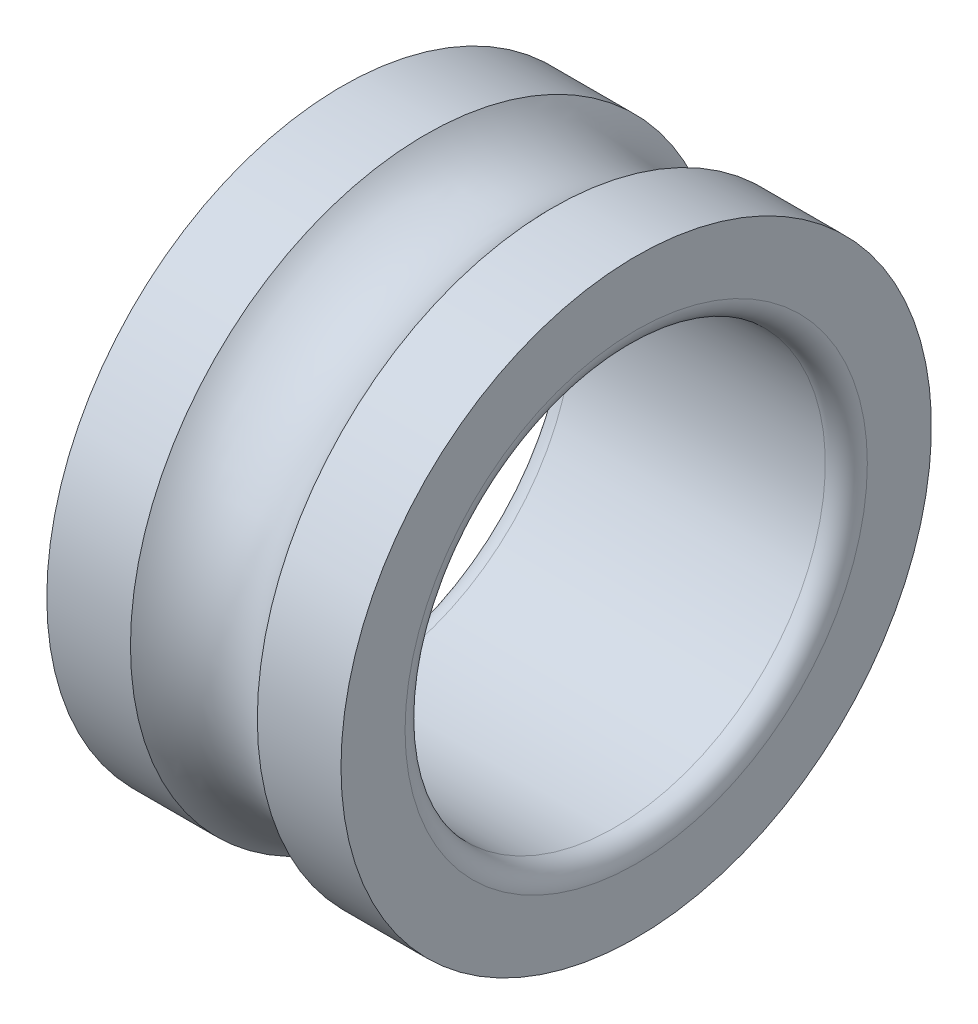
ISO-10303-21;
HEADER;
FILE_DESCRIPTION(('STEP AP214'),'2;1');
FILE_NAME('part.step','',(''),(''),'','','');
FILE_SCHEMA(('AUTOMOTIVE_DESIGN { 1 0 10303 214 1 1 1 1 }'));
ENDSEC;
DATA;
#1=APPLICATION_CONTEXT('core data for automotive mechanical design processes');
#2=APPLICATION_PROTOCOL_DEFINITION('international standard','automotive_design',2000,#1);
#3=PRODUCT_CONTEXT('',#1,'mechanical');
#4=PRODUCT('Part','Part','',(#3));
#5=PRODUCT_RELATED_PRODUCT_CATEGORY('part','',(#4));
#6=PRODUCT_DEFINITION_FORMATION('','',#4);
#7=PRODUCT_DEFINITION_CONTEXT('part definition',#1,'design');
#8=PRODUCT_DEFINITION('design','',#6,#7);
#9=PRODUCT_DEFINITION_SHAPE('','',#8);
#10=(LENGTH_UNIT() NAMED_UNIT(*) SI_UNIT(.MILLI.,.METRE.));
#11=(NAMED_UNIT(*) PLANE_ANGLE_UNIT() SI_UNIT($,.RADIAN.));
#12=(NAMED_UNIT(*) SI_UNIT($,.STERADIAN.) SOLID_ANGLE_UNIT());
#13=UNCERTAINTY_MEASURE_WITH_UNIT(LENGTH_MEASURE(1.E-05),#10,'distance_accuracy_value','');
#14=(GEOMETRIC_REPRESENTATION_CONTEXT(3) GLOBAL_UNCERTAINTY_ASSIGNED_CONTEXT((#13)) GLOBAL_UNIT_ASSIGNED_CONTEXT((#10,
#11,#12)) REPRESENTATION_CONTEXT('',''));
#15=CARTESIAN_POINT('',(0.,0.,0.));
#16=DIRECTION('',(0.,0.,1.));
#17=DIRECTION('',(1.,0.,0.));
#18=AXIS2_PLACEMENT_3D('',#15,#16,#17);
#19=CARTESIAN_POINT('',(1.,0.,0.));
#20=DIRECTION('',(-1.,0.,0.));
#21=DIRECTION('',(0.,0.,1.));
#22=AXIS2_PLACEMENT_3D('',#19,#20,#21);
#23=TOROIDAL_SURFACE('',#22,11.,0.999999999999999);
#24=CARTESIAN_POINT('',(1.00000000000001,0.,0.));
#25=DIRECTION('',(-1.,0.,0.));
#26=DIRECTION('',(0.,0.,1.));
#27=AXIS2_PLACEMENT_3D('',#24,#25,#26);
#28=CIRCLE('',#27,10.);
#29=CARTESIAN_POINT('',(1.00000000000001,0.,10.));
#30=VERTEX_POINT('',#29);
#31=EDGE_CURVE('E10',#30,#30,#28,.T.);
#32=ORIENTED_EDGE('',*,*,#31,.F.);
#33=EDGE_LOOP('',(#32));
#34=FACE_BOUND('',#33,.T.);
#35=CARTESIAN_POINT('',(0.,0.,0.));
#36=DIRECTION('',(-1.,0.,0.));
#37=DIRECTION('',(0.,0.,1.));
#38=AXIS2_PLACEMENT_3D('',#35,#36,#37);
#39=CIRCLE('',#38,11.);
#40=CARTESIAN_POINT('',(0.,0.,11.));
#41=VERTEX_POINT('',#40);
#42=EDGE_CURVE('E53',#41,#41,#39,.T.);
#43=ORIENTED_EDGE('',*,*,#42,.T.);
#44=EDGE_LOOP('',(#43));
#45=FACE_BOUND('',#44,.T.);
#46=ADVANCED_FACE('F25',(#34,#45),#23,.T.);
#47=CARTESIAN_POINT('',(0.,0.,0.));
#48=DIRECTION('',(-1.,0.,0.));
#49=DIRECTION('',(0.,0.,1.));
#50=AXIS2_PLACEMENT_3D('',#47,#48,#49);
#51=CYLINDRICAL_SURFACE('',#50,10.);
#52=CARTESIAN_POINT('',(13.,0.,0.));
#53=DIRECTION('',(-1.,0.,0.));
#54=DIRECTION('',(0.,0.,1.));
#55=AXIS2_PLACEMENT_3D('',#52,#53,#54);
#56=CIRCLE('',#55,10.);
#57=CARTESIAN_POINT('',(13.,0.,10.));
#58=VERTEX_POINT('',#57);
#59=EDGE_CURVE('E31',#58,#58,#56,.T.);
#60=ORIENTED_EDGE('',*,*,#59,.F.);
#61=EDGE_LOOP('',(#60));
#62=FACE_BOUND('',#61,.T.);
#63=ORIENTED_EDGE('',*,*,#31,.T.);
#64=EDGE_LOOP('',(#63));
#65=FACE_BOUND('',#64,.T.);
#66=ADVANCED_FACE('F90',(#62,#65),#51,.F.);
#67=CARTESIAN_POINT('',(13.,0.,0.));
#68=DIRECTION('',(-1.,0.,0.));
#69=DIRECTION('',(0.,0.,1.));
#70=AXIS2_PLACEMENT_3D('',#67,#68,#69);
#71=TOROIDAL_SURFACE('',#70,11.,0.999999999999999);
#72=CARTESIAN_POINT('',(14.,0.,0.));
#73=DIRECTION('',(-1.,0.,0.));
#74=DIRECTION('',(0.,0.,1.));
#75=AXIS2_PLACEMENT_3D('',#72,#73,#74);
#76=CIRCLE('',#75,11.);
#77=CARTESIAN_POINT('',(14.,0.,11.));
#78=VERTEX_POINT('',#77);
#79=EDGE_CURVE('E35',#78,#78,#76,.T.);
#80=ORIENTED_EDGE('',*,*,#79,.F.);
#81=EDGE_LOOP('',(#80));
#82=FACE_BOUND('',#81,.T.);
#83=ORIENTED_EDGE('',*,*,#59,.T.);
#84=EDGE_LOOP('',(#83));
#85=FACE_BOUND('',#84,.T.);
#86=ADVANCED_FACE('F85',(#82,#85),#71,.T.);
#87=CARTESIAN_POINT('',(14.,0.,-14.05));
#88=DIRECTION('',(-1.,0.,0.));
#89=DIRECTION('',(0.,0.,1.));
#90=AXIS2_PLACEMENT_3D('',#87,#88,#89);
#91=PLANE('',#90);
#92=CARTESIAN_POINT('',(14.,0.,0.));
#93=DIRECTION('',(-1.,0.,0.));
#94=DIRECTION('',(0.,0.,1.));
#95=AXIS2_PLACEMENT_3D('',#92,#93,#94);
#96=CIRCLE('',#95,14.05);
#97=CARTESIAN_POINT('',(14.,0.,14.05));
#98=VERTEX_POINT('',#97);
#99=EDGE_CURVE('E39',#98,#98,#96,.T.);
#100=ORIENTED_EDGE('',*,*,#99,.F.);
#101=EDGE_LOOP('',(#100));
#102=FACE_BOUND('',#101,.T.);
#103=ORIENTED_EDGE('',*,*,#79,.T.);
#104=EDGE_LOOP('',(#103));
#105=FACE_BOUND('',#104,.T.);
#106=ADVANCED_FACE('F79',(#102,#105),#91,.F.);
#107=CARTESIAN_POINT('',(0.,0.,0.));
#108=DIRECTION('',(-1.,0.,0.));
#109=DIRECTION('',(0.,0.,1.));
#110=AXIS2_PLACEMENT_3D('',#107,#108,#109);
#111=CYLINDRICAL_SURFACE('',#110,14.05);
#112=CARTESIAN_POINT('',(10.0186917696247,0.,0.));
#113=DIRECTION('',(-1.,0.,0.));
#114=DIRECTION('',(0.,0.,1.));
#115=AXIS2_PLACEMENT_3D('',#112,#113,#114);
#116=CIRCLE('',#115,14.05);
#117=CARTESIAN_POINT('',(10.0186917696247,0.,14.05));
#118=VERTEX_POINT('',#117);
#119=EDGE_CURVE('E44',#118,#118,#116,.T.);
#120=ORIENTED_EDGE('',*,*,#119,.F.);
#121=EDGE_LOOP('',(#120));
#122=FACE_BOUND('',#121,.T.);
#123=ORIENTED_EDGE('',*,*,#99,.T.);
#124=EDGE_LOOP('',(#123));
#125=FACE_BOUND('',#124,.T.);
#126=ADVANCED_FACE('F73',(#122,#125),#111,.T.);
#127=CARTESIAN_POINT('',(7.,0.,0.));
#128=DIRECTION('',(-1.,0.,0.));
#129=DIRECTION('',(0.,0.,1.));
#130=AXIS2_PLACEMENT_3D('',#127,#128,#129);
#131=TOROIDAL_SURFACE('',#130,16.75,4.05);
#132=CARTESIAN_POINT('',(3.98130823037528,0.,0.));
#133=DIRECTION('',(-1.,0.,0.));
#134=DIRECTION('',(0.,0.,1.));
#135=AXIS2_PLACEMENT_3D('',#132,#133,#134);
#136=CIRCLE('',#135,14.05);
#137=CARTESIAN_POINT('',(3.98130823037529,0.,14.05));
#138=VERTEX_POINT('',#137);
#139=EDGE_CURVE('E47',#138,#138,#136,.T.);
#140=ORIENTED_EDGE('',*,*,#139,.F.);
#141=EDGE_LOOP('',(#140));
#142=FACE_BOUND('',#141,.T.);
#143=ORIENTED_EDGE('',*,*,#119,.T.);
#144=EDGE_LOOP('',(#143));
#145=FACE_BOUND('',#144,.T.);
#146=ADVANCED_FACE('F67',(#142,#145),#131,.F.);
#147=CARTESIAN_POINT('',(0.,0.,0.));
#148=DIRECTION('',(-1.,0.,0.));
#149=DIRECTION('',(0.,0.,1.));
#150=AXIS2_PLACEMENT_3D('',#147,#148,#149);
#151=CYLINDRICAL_SURFACE('',#150,14.05);
#152=CARTESIAN_POINT('',(0.,0.,0.));
#153=DIRECTION('',(-1.,0.,0.));
#154=DIRECTION('',(0.,0.,1.));
#155=AXIS2_PLACEMENT_3D('',#152,#153,#154);
#156=CIRCLE('',#155,14.05);
#157=CARTESIAN_POINT('',(0.,0.,14.05));
#158=VERTEX_POINT('',#157);
#159=EDGE_CURVE('E50',#158,#158,#156,.T.);
#160=ORIENTED_EDGE('',*,*,#159,.F.);
#161=EDGE_LOOP('',(#160));
#162=FACE_BOUND('',#161,.T.);
#163=ORIENTED_EDGE('',*,*,#139,.T.);
#164=EDGE_LOOP('',(#163));
#165=FACE_BOUND('',#164,.T.);
#166=ADVANCED_FACE('F61',(#162,#165),#151,.T.);
#167=CARTESIAN_POINT('',(0.,0.,-14.05));
#168=DIRECTION('',(1.,0.,0.));
#169=DIRECTION('',(0.,0.,-1.));
#170=AXIS2_PLACEMENT_3D('',#167,#168,#169);
#171=PLANE('',#170);
#172=ORIENTED_EDGE('',*,*,#42,.F.);
#173=EDGE_LOOP('',(#172));
#174=FACE_BOUND('',#173,.T.);
#175=ORIENTED_EDGE('',*,*,#159,.T.);
#176=EDGE_LOOP('',(#175));
#177=FACE_BOUND('',#176,.T.);
#178=ADVANCED_FACE('F58',(#174,#177),#171,.F.);
#179=CLOSED_SHELL('',(#46,#66,#86,#106,#126,#146,#166,#178));
#180=MANIFOLD_SOLID_BREP('B2',#179);
#181=ADVANCED_BREP_SHAPE_REPRESENTATION('',(#18,#180),#14);
#182=SHAPE_DEFINITION_REPRESENTATION(#9,#181);
ENDSEC;
END-ISO-10303-21;
